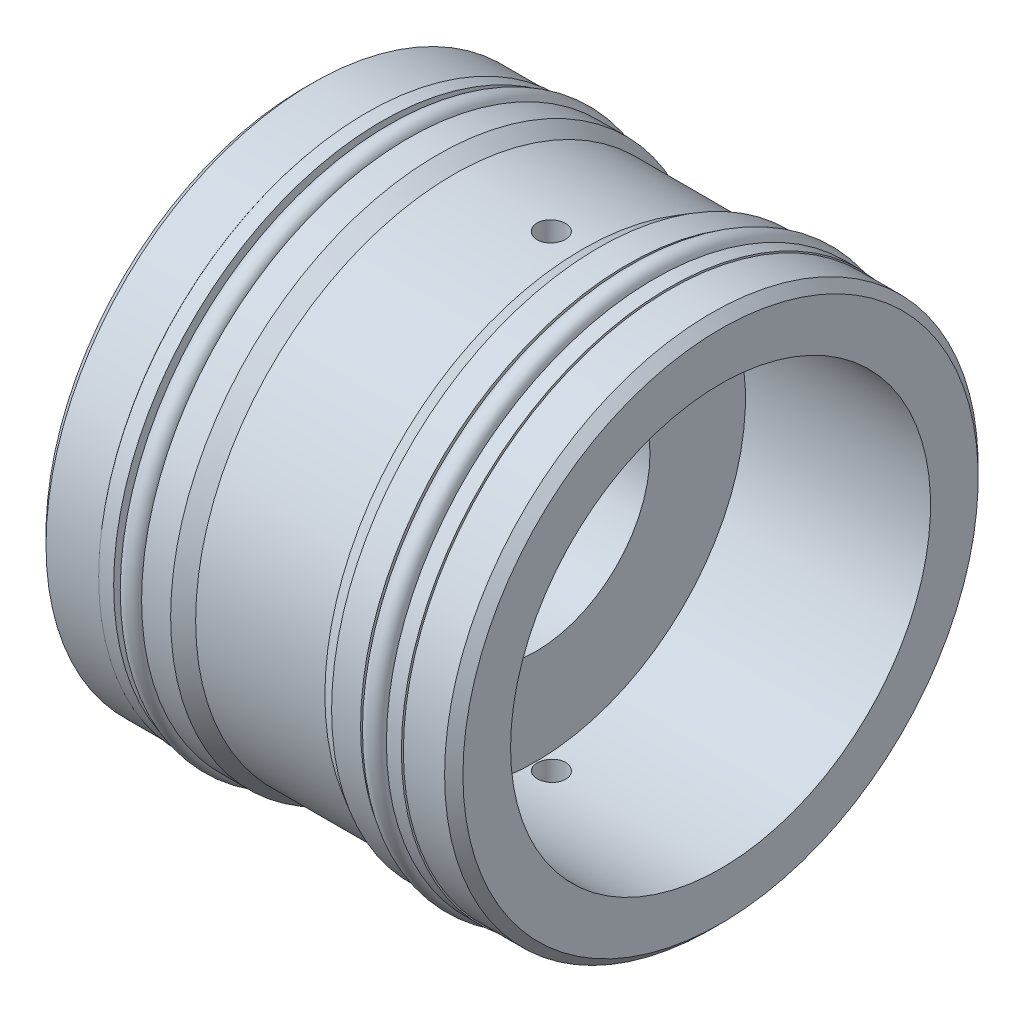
from build123d import *

# Parameters (mm, degrees)
FILLET1_R               = 0.381
CHAMFER1_SIZE           = 0.762
SKETCH6_R               = 0.889
SKETCH6_W               = 1.2446
SKETCH6_H               = 1.3462
CUT_EXTRUDE1_DEPTH      = 37.398902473
CUT_EXTRUDE1_DEPTH_BACK = 37.398902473
SKETCH7_R               = 1.1811


with BuildPart() as part:
    # Sketch1 → Revolve1 (revolve)
    with BuildSketch(Plane.XY, mode=Mode.PRIVATE) as revolve1_sk:
        Polygon((-17.3355, 9.525), (-17.3355, 22.1869), (-12.1793, 22.1869), (-12.1793, 20.9296), (-8.6233, 20.9296), (-8.6233, 22.1869), (-6.2103, 22.1869), (-6.2103, 21.4249), (7.1755, 21.4249), (7.1755, 22.1869), (9.5885, 22.1869), (9.5885, 20.9296), (13.1445, 20.9296), (13.1445, 22.1869), (17.3355, 22.1869), (17.3355, 17.4625), (1.9431, 17.4625), (1.9431, 9.525), align=None)
    revolve(revolve1_sk.sketch.rotate(Axis((0, 0, 0), (1, 0, 0)), 90), axis=Axis((0, 0, 0), (1, 0, 0)))

    # Fillet1
    fillet1_edges = [part.edges().sort_by_distance(p)[0] for p in [
        (-6.2103, 0, -21.4249),
        (7.1755, 0, -21.4249),
    ]]
    fillet(fillet1_edges, radius=FILLET1_R)

    # Chamfer1
    chamfer1_edges = [part.edges().sort_by_distance(p)[0] for p in [
        (-17.3355, 0, -22.1869),
        (17.3355, 0, -22.1869),
    ]]
    chamfer(chamfer1_edges, length=CHAMFER1_SIZE)

    # Sketch6 → Revolve3 (revolve)
    with BuildSketch(Plane.XY, mode=Mode.PRIVATE) as revolve3_sk:
        with Locations((-9.5885, 21.7424)):
            Circle(SKETCH6_R)
        with Locations((10.5537, 21.7424)):
            Circle(SKETCH6_R)
        with Locations((-11.4808, 21.6027)):
            Rectangle(SKETCH6_W, SKETCH6_H)
        with Locations((12.446, 21.6027)):
            Rectangle(SKETCH6_W, SKETCH6_H)
    revolve(revolve3_sk.sketch.rotate(Axis((0, 0, 0), (1, 0, 0)), 90), axis=Axis((0, 0, 0), (1, 0, 0)))

    # Sketch7 → Cut-Extrude1 (cut, two sides: drawn at the far end of the back side and taken through both)
    with BuildSketch(Plane(origin=(0, 0, 0), x_dir=(0, 0, -1), z_dir=(0, 1, 0)).offset(-CUT_EXTRUDE1_DEPTH_BACK)):
        with Locations(Location((0, -3.2639, 0), (0, 0, 180))):
            Circle(SKETCH7_R)
    extrude(amount=CUT_EXTRUDE1_DEPTH + CUT_EXTRUDE1_DEPTH_BACK, mode=Mode.SUBTRACT)

    # Sketch8 → Revolve4 (revolve)
    with BuildSketch(Plane.XY, mode=Mode.PRIVATE) as revolve4_sk:
        Polygon((7.1755, 22.1869), (5.855677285, 21.4249), (7.1755, 21.4249), align=None)
        Polygon((-6.2103, 21.4249), (-6.2103, 22.1869), (-4.890477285, 21.4249), align=None)
    revolve(revolve4_sk.sketch.rotate(Axis((0, 0, 0), (1, 0, 0)), 90), axis=Axis((0, 0, 0), (1, 0, 0)))


solid = part.part
